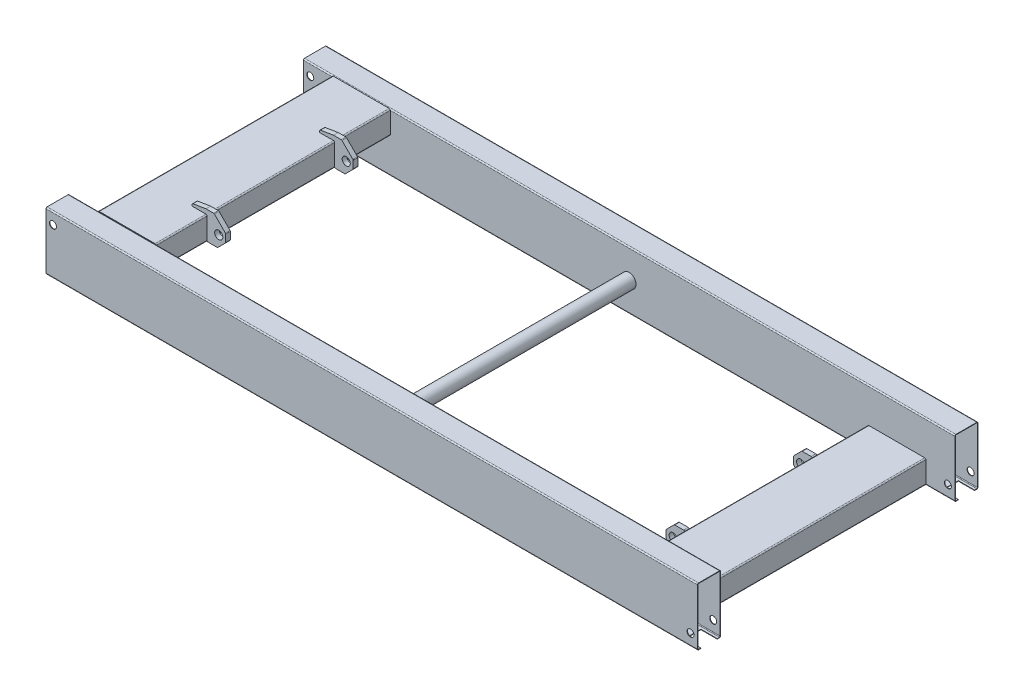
from build123d import *

# Parameters (mm, degrees)
C_250X100X2_1_DEPTH   = 2810
C_250X100X2_1_2_DEPTH = 2810
C_250X100X2_2_DEPTH   = 1010
C_250X100X2_2_2_DEPTH = 1010
SKETCH14_R            = 15
CUT_EXTRUDE1_DEPTH    = 1859.426754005
BOSS_EXTRUDE1_REACH   = 1796.923
SKETCH15_R            = 30
SKETCH16_W            = 70
SKETCH16_H            = 70
CUT_EXTRUDE2_DEPTH    = 10
SKETCH17_R            = 17.5
BOSS_EXTRUDE2_DEPTH   = 285
BOSS_EXTRUDE2_2_DEPTH = 285
SKETCH17_2_R          = 17.5
CUT_EXTRUDE3_DEPTH    = 265


with BuildPart() as part:
    # Sketch11 → C 250X100X2_1 (new body)
    with BuildSketch(Plane(origin=(-1405, 0, -555), x_dir=(0, 1, 0), z_dir=(1, 0, 0))):
        with BuildLine():
            Line((-120, 50), (120, 50))
            ThreePointArc((120, 50), (123.535533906, 48.535533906), (125, 45))
            Line((125, 45), (125, -45))
            ThreePointArc((125, -45), (123.535533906, -48.535533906), (120, -50))
            Line((120, -50), (-120, -50))
            ThreePointArc((-120, -50), (-123.535533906, -48.535533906), (-125, -45))
            Line((-125, -45), (-125, 45))
            ThreePointArc((-125, 45), (-123.535533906, 48.535533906), (-120, 50))
        make_face()
        with BuildLine():
            Line((-123, 45), (-123, -45))
            ThreePointArc((-123, -45), (-122.121320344, -47.121320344), (-120, -48))
            Line((-120, -48), (120, -48))
            ThreePointArc((120, -48), (122.121320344, -47.121320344), (123, -45))
            Line((123, -45), (123, 45))
            ThreePointArc((123, 45), (122.121320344, 47.121320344), (120, 48))
            Line((120, 48), (-120, 48))
            ThreePointArc((-120, 48), (-122.121320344, 47.121320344), (-123, 45))
        make_face(mode=Mode.SUBTRACT)
    extrude(amount=C_250X100X2_1_DEPTH)


with BuildPart() as body_2:
    # Sketch11 on segment 2 (on carried to segment 2) → C 250X100X2_1 2 (new body)
    with BuildSketch(Plane(origin=(-1405, 0, 555), x_dir=(0, 1, 0), z_dir=(1, 0, 0))):
        with BuildLine():
            Line((-120, 50), (120, 50))
            ThreePointArc((120, 50), (123.535533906, 48.535533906), (125, 45))
            Line((125, 45), (125, -45))
            ThreePointArc((125, -45), (123.535533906, -48.535533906), (120, -50))
            Line((120, -50), (-120, -50))
            ThreePointArc((-120, -50), (-123.535533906, -48.535533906), (-125, -45))
            Line((-125, -45), (-125, 45))
            ThreePointArc((-125, 45), (-123.535533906, 48.535533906), (-120, 50))
        make_face()
        with BuildLine():
            Line((-123, 45), (-123, -45))
            ThreePointArc((-123, -45), (-122.121320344, -47.121320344), (-120, -48))
            Line((-120, -48), (120, -48))
            ThreePointArc((120, -48), (122.121320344, -47.121320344), (123, -45))
            Line((123, -45), (123, 45))
            ThreePointArc((123, 45), (122.121320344, 47.121320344), (120, 48))
            Line((120, 48), (-120, 48))
            ThreePointArc((-120, 48), (-122.121320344, 47.121320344), (-123, 45))
        make_face(mode=Mode.SUBTRACT)
    extrude(amount=C_250X100X2_1_2_DEPTH)


with BuildPart() as body_3:
    # Sketch13 → C 250X100X2_2 (new body)
    with BuildSketch(Plane(origin=(1155, -75, -505), x_dir=(1, 0, 0), z_dir=(0, 0, 1))):
        with BuildLine():
            Line((-120, 50), (120, 50))
            ThreePointArc((120, 50), (123.535533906, 48.535533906), (125, 45))
            Line((125, 45), (125, -45))
            ThreePointArc((125, -45), (123.535533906, -48.535533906), (120, -50))
            Line((120, -50), (-120, -50))
            ThreePointArc((-120, -50), (-123.535533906, -48.535533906), (-125, -45))
            Line((-125, -45), (-125, 45))
            ThreePointArc((-125, 45), (-123.535533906, 48.535533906), (-120, 50))
        make_face()
        with BuildLine():
            Line((-123, 45), (-123, -45))
            ThreePointArc((-123, -45), (-122.121320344, -47.121320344), (-120, -48))
            Line((-120, -48), (120, -48))
            ThreePointArc((120, -48), (122.121320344, -47.121320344), (123, -45))
            Line((123, -45), (123, 45))
            ThreePointArc((123, 45), (122.121320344, 47.121320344), (120, 48))
            Line((120, 48), (-120, 48))
            ThreePointArc((-120, 48), (-122.121320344, 47.121320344), (-123, 45))
        make_face(mode=Mode.SUBTRACT)
    extrude(amount=C_250X100X2_2_DEPTH)


with BuildPart() as body_4:
    # Sketch13 on segment 2 (on carried to segment 2) → C 250X100X2_2 2 (new body)
    with BuildSketch(Plane(origin=(-1155, 75, -505), x_dir=(1, 0, 0), z_dir=(0, 0, 1))):
        with BuildLine():
            Line((-120, 50), (120, 50))
            ThreePointArc((120, 50), (123.535533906, 48.535533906), (125, 45))
            Line((125, 45), (125, -45))
            ThreePointArc((125, -45), (123.535533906, -48.535533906), (120, -50))
            Line((120, -50), (-120, -50))
            ThreePointArc((-120, -50), (-123.535533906, -48.535533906), (-125, -45))
            Line((-125, -45), (-125, 45))
            ThreePointArc((-125, 45), (-123.535533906, 48.535533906), (-120, 50))
        make_face()
        with BuildLine():
            Line((-123, 45), (-123, -45))
            ThreePointArc((-123, -45), (-122.121320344, -47.121320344), (-120, -48))
            Line((-120, -48), (120, -48))
            ThreePointArc((120, -48), (122.121320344, -47.121320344), (123, -45))
            Line((123, -45), (123, 45))
            ThreePointArc((123, 45), (122.121320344, 47.121320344), (120, 48))
            Line((120, 48), (-120, 48))
            ThreePointArc((-120, 48), (-122.121320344, 47.121320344), (-123, 45))
        make_face(mode=Mode.SUBTRACT)
    extrude(amount=C_250X100X2_2_2_DEPTH)


with BuildPart() as cut_extrude1_tool:
    # Sketch14 → Cut-Extrude1 (new, through all)
    with BuildSketch(Plane.XY.offset(605)):
        with Locations(Location((1375, -75, 0), (0, 0, 270))):
            Circle(SKETCH14_R)
        with Locations(Location((-1375, 75, 0), (0, 0, 270))):
            Circle(SKETCH14_R)
    extrude(amount=-CUT_EXTRUDE1_DEPTH)


with BuildPart() as part_1:
    add(part.part)

    # Cut-Extrude1: cut by cut_extrude1_tool
    add(cut_extrude1_tool.part, mode=Mode.SUBTRACT)


with BuildPart() as body_2_1:
    add(body_2.part)

    # Cut-Extrude1: cut by cut_extrude1_tool
    add(cut_extrude1_tool.part, mode=Mode.SUBTRACT)


with BuildPart() as body_5:

    # Sketch15 → Boss-Extrude1 (new, up to next)
    with BuildSketch(Plane.XY.offset(-505), mode=Mode.PRIVATE) as boss_extrude1_sk1:
        with Locations(Location((0, 0, 0), (0, 0, 270))):
            Circle(SKETCH15_R)
    boss_extrude1_tool1 = extrude(boss_extrude1_sk1.sketch, amount=BOSS_EXTRUDE1_REACH, mode=Mode.PRIVATE) - body_2_1.part
    add(boss_extrude1_tool1.solids().sort_by_distance((0, 0, -505))[0])


with BuildPart() as cut_extrude2_tool:
    # Sketch16 → Cut-Extrude2 (new body)
    with BuildSketch(Plane.XZ.offset(125)):
        with Locations((1370, 555)):
            Rectangle(SKETCH16_W, SKETCH16_H)
        with Locations((1370, -555)):
            Rectangle(SKETCH16_W, SKETCH16_H)
    extrude(amount=-CUT_EXTRUDE2_DEPTH)


with BuildPart() as part_2:
    add(part_1.part)

    # Cut-Extrude2: cut by cut_extrude2_tool
    add(cut_extrude2_tool.part, mode=Mode.SUBTRACT)


with BuildPart() as body_2_2:
    add(body_2_1.part)

    # Cut-Extrude2: cut by cut_extrude2_tool
    add(cut_extrude2_tool.part, mode=Mode.SUBTRACT)


with BuildPart() as body_6:
    # Sketch17 → Boss-Extrude2 (new, symmetric)
    with BuildSketch(Plane.XY):
        with BuildLine():
            Line((1095, -125), (1035, -125))
            ThreePointArc((1035, -125), (1031.464466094, -123.535533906), (1030, -120))
            Line((1030, -120), (1030, -30))
            ThreePointArc((1030, -30), (1028.535533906, -26.464466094), (1025, -25))
            Line((1025, -25), (987.071067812, -25))
            ThreePointArc((987.071067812, -25), (985.15765065, -25.380602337), (983.535533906, -26.464466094))
            Line((983.535533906, -26.464466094), (951.464466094, -58.535533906))
            ThreePointArc((951.464466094, -58.535533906), (950.380602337, -60.15765065), (950, -62.071067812))
            Line((950, -62.071067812), (950, -92.928932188))
            ThreePointArc((950, -92.928932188), (950.380602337, -94.84234935), (951.464466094, -96.464466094))
            Line((951.464466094, -96.464466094), (998.535533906, -143.535533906))
            ThreePointArc((998.535533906, -143.535533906), (1000.15765065, -144.619397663), (1002.071067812, -145))
            Line((1002.071067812, -145), (1034.586187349, -145))
            ThreePointArc((1034.586187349, -145), (1034.998590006, -144.98296338), (1035.408182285, -144.931969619))
            Line((1035.408182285, -144.931969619), (1090.821994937, -135.696334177))
            ThreePointArc((1090.821994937, -135.696334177), (1093.815099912, -133.996239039), (1095, -130.764364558))
            Line((1095, -130.764364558), (1095, -125))
        make_face()
        with Locations((980, -75)):
            Circle(SKETCH17_R, mode=Mode.SUBTRACT)
    extrude(amount=BOSS_EXTRUDE2_DEPTH, both=True)


with BuildPart() as body_7:
    # Sketch17 → Boss-Extrude2 2 (new, symmetric)
    with BuildSketch(Plane.XY):
        with BuildLine():
            Line((-1095, 125), (-1035, 125))
            ThreePointArc((-1035, 125), (-1031.464466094, 123.535533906), (-1030, 120))
            Line((-1030, 120), (-1030, 30))
            ThreePointArc((-1030, 30), (-1028.535533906, 26.464466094), (-1025, 25))
            Line((-1025, 25), (-987.071067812, 25))
            ThreePointArc((-987.071067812, 25), (-985.15765065, 25.380602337), (-983.535533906, 26.464466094))
            Line((-983.535533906, 26.464466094), (-951.464466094, 58.535533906))
            ThreePointArc((-951.464466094, 58.535533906), (-950.380602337, 60.15765065), (-950, 62.071067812))
            Line((-950, 62.071067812), (-950, 92.928932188))
            ThreePointArc((-950, 92.928932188), (-950.380602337, 94.84234935), (-951.464466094, 96.464466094))
            Line((-951.464466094, 96.464466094), (-998.535533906, 143.535533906))
            ThreePointArc((-998.535533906, 143.535533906), (-1000.15765065, 144.619397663), (-1002.071067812, 145))
            Line((-1002.071067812, 145), (-1034.586187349, 145))
            ThreePointArc((-1034.586187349, 145), (-1034.998590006, 144.98296338), (-1035.408182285, 144.931969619))
            Line((-1035.408182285, 144.931969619), (-1090.821994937, 135.696334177))
            ThreePointArc((-1090.821994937, 135.696334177), (-1093.815099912, 133.996239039), (-1095, 130.764364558))
            Line((-1095, 130.764364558), (-1095, 125))
        make_face()
        with Locations((-980, 75)):
            Circle(SKETCH17_R, mode=Mode.SUBTRACT)
    extrude(amount=BOSS_EXTRUDE2_2_DEPTH, both=True)


with BuildPart() as cut_extrude3_tool:
    # Sketch17_2 → Cut-Extrude3 (new, symmetric)
    # profile 1 of 2: a face of its own
    with BuildSketch(Plane.XY):
        with BuildLine():
            Line((1095, -125), (1035, -125))
            ThreePointArc((1035, -125), (1031.464466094, -123.535533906), (1030, -120))
            Line((1030, -120), (1030, -30))
            ThreePointArc((1030, -30), (1028.535533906, -26.464466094), (1025, -25))
            Line((1025, -25), (987.071067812, -25))
            ThreePointArc((987.071067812, -25), (985.15765065, -25.380602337), (983.535533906, -26.464466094))
            Line((983.535533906, -26.464466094), (951.464466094, -58.535533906))
            ThreePointArc((951.464466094, -58.535533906), (950.380602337, -60.15765065), (950, -62.071067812))
            Line((950, -62.071067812), (950, -92.928932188))
            ThreePointArc((950, -92.928932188), (950.380602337, -94.84234935), (951.464466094, -96.464466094))
            Line((951.464466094, -96.464466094), (998.535533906, -143.535533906))
            ThreePointArc((998.535533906, -143.535533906), (1000.15765065, -144.619397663), (1002.071067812, -145))
            Line((1002.071067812, -145), (1034.586187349, -145))
            ThreePointArc((1034.586187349, -145), (1034.998590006, -144.98296338), (1035.408182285, -144.931969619))
            Line((1035.408182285, -144.931969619), (1090.821994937, -135.696334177))
            ThreePointArc((1090.821994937, -135.696334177), (1093.815099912, -133.996239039), (1095, -130.764364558))
            Line((1095, -130.764364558), (1095, -125))
        make_face()
        with Locations((980, -75)):
            Circle(SKETCH17_2_R, mode=Mode.SUBTRACT)
    # profile 2 of 2: a face of its own
    with BuildSketch(Plane.XY):
        with BuildLine():
            Line((-1095, 125), (-1035, 125))
            ThreePointArc((-1035, 125), (-1031.464466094, 123.535533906), (-1030, 120))
            Line((-1030, 120), (-1030, 30))
            ThreePointArc((-1030, 30), (-1028.535533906, 26.464466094), (-1025, 25))
            Line((-1025, 25), (-987.071067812, 25))
            ThreePointArc((-987.071067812, 25), (-985.15765065, 25.380602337), (-983.535533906, 26.464466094))
            Line((-983.535533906, 26.464466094), (-951.464466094, 58.535533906))
            ThreePointArc((-951.464466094, 58.535533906), (-950.380602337, 60.15765065), (-950, 62.071067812))
            Line((-950, 62.071067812), (-950, 92.928932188))
            ThreePointArc((-950, 92.928932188), (-950.380602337, 94.84234935), (-951.464466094, 96.464466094))
            Line((-951.464466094, 96.464466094), (-998.535533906, 143.535533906))
            ThreePointArc((-998.535533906, 143.535533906), (-1000.15765065, 144.619397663), (-1002.071067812, 145))
            Line((-1002.071067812, 145), (-1034.586187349, 145))
            ThreePointArc((-1034.586187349, 145), (-1034.998590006, 144.98296338), (-1035.408182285, 144.931969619))
            Line((-1035.408182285, 144.931969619), (-1090.821994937, 135.696334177))
            ThreePointArc((-1090.821994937, 135.696334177), (-1093.815099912, 133.996239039), (-1095, 130.764364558))
            Line((-1095, 130.764364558), (-1095, 125))
        make_face()
        with Locations((-980, 75)):
            Circle(SKETCH17_2_R, mode=Mode.SUBTRACT)
    extrude(amount=CUT_EXTRUDE3_DEPTH, both=True)


with BuildPart() as body_6_1:
    add(body_6.part)

    # Cut-Extrude3: cut by cut_extrude3_tool
    add(cut_extrude3_tool.part, mode=Mode.SUBTRACT)


with BuildPart() as body_7_1:
    add(body_7.part)

    # Cut-Extrude3: cut by cut_extrude3_tool
    add(cut_extrude3_tool.part, mode=Mode.SUBTRACT)


with BuildPart() as cut_extrude3_piece_1:
    # of the separate pieces the step leaves, piece 1, a body of its own (cut_extrude3_pieces)
    add(body_6_1.part.solids().sort_by_distance((1025, -25, -265))[0])


with BuildPart() as cut_extrude3_piece_2:
    # of the separate pieces the step leaves, piece 2, a body of its own (cut_extrude3_pieces)
    add(body_6_1.part.solids().sort_by_distance((1025, -25, 285))[0])


with BuildPart() as cut_extrude3_piece_1_of_body_7:
    # of the separate pieces the step leaves, piece 1, a body of its own (cut_extrude3_pieces_of_body_7)
    add(body_7_1.part.solids().sort_by_distance((-1025, 25, -265))[0])


with BuildPart() as cut_extrude3_piece_2_of_body_7:
    # of the separate pieces the step leaves, piece 2, a body of its own (cut_extrude3_pieces_of_body_7)
    add(body_7_1.part.solids().sort_by_distance((-1025, 25, 285))[0])


solid = Compound([body_3.part, body_4.part, body_5.part, part_2.part, body_2_2.part, cut_extrude3_piece_1.part, cut_extrude3_piece_2.part, cut_extrude3_piece_1_of_body_7.part, cut_extrude3_piece_2_of_body_7.part])
